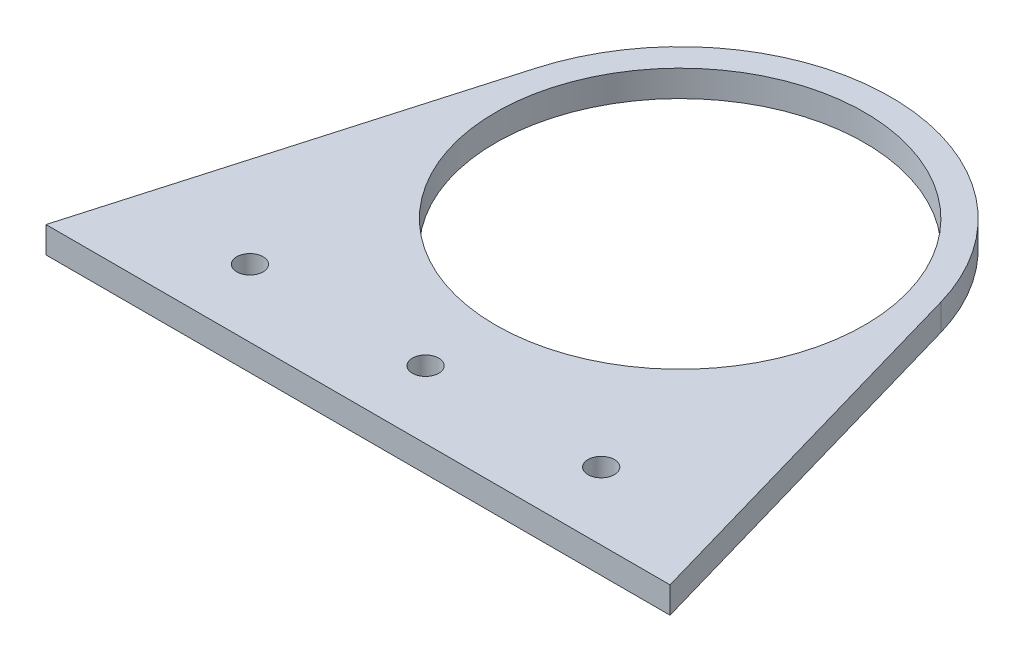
from build123d import *

# Parameters (mm, degrees)
SKETCH_1_R      = 21
SKETCH_1_R_2    = 1.5
EXTRUDE_1_DEPTH = 3


with BuildPart() as part:
    # Sketch 1 → Extrude 1 (new body)
    with BuildSketch(Plane(origin=(0, 0, 0), x_dir=(1, 0, 0), z_dir=(0, 1, 0))):
        with BuildLine():
            Line((-17.341721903, -38.526002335), (-4.873569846, 4.793106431))
            ThreePointArc((-4.873569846, 4.793106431), (18.190126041, 22.154888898), (41.253821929, 4.793106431))
            Line((41.253821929, 4.793106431), (53.721973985, -38.526002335))
            Line((53.721973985, -38.526002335), (-17.341721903, -38.526002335))
        make_face()
        with Locations(Location((18.190126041, -1.845111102, 0), (0, 0, 270))):
            Circle(SKETCH_1_R, mode=Mode.SUBTRACT)
        with Locations(Location((-1.809873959, -30.835008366, 0), (0, 0, 270))):
            Circle(SKETCH_1_R_2, mode=Mode.SUBTRACT)
        with Locations(Location((18.190126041, -30.835008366, 0), (0, 0, 270))):
            Circle(SKETCH_1_R_2, mode=Mode.SUBTRACT)
        with Locations(Location((38.190126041, -30.835008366, 0), (0, 0, 270))):
            Circle(SKETCH_1_R_2, mode=Mode.SUBTRACT)
    extrude(amount=EXTRUDE_1_DEPTH)


solid = part.part
